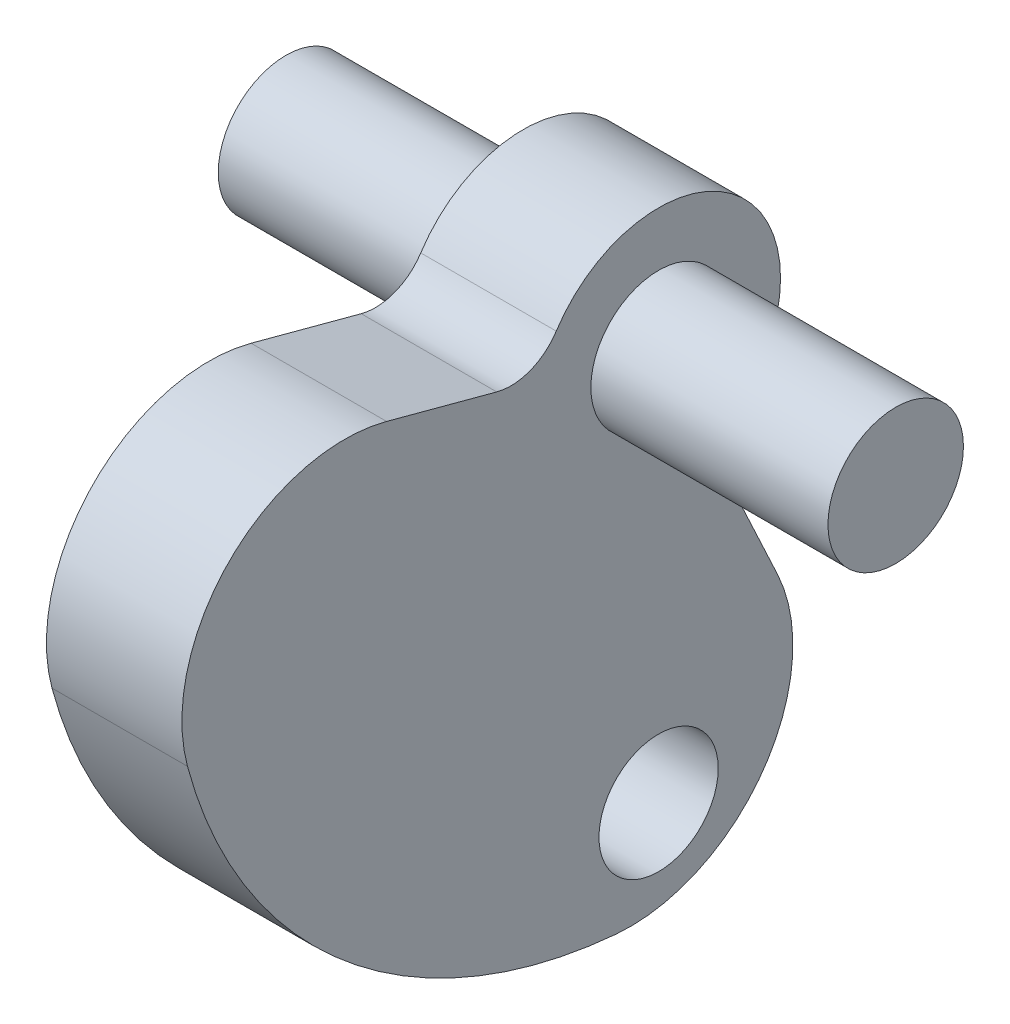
from build123d import *

# Parameters (mm, degrees)
SKETCH1_R      = 2.794
EXTRUDE1_DEPTH = 3.175
SKETCH2_R      = 3.175
EXTRUDE2_DEPTH = 14.2875
FILLET1_R      = 7.62


with BuildPart() as part:
    # Sketch1 → Extrude1 (new, symmetric)
    with BuildSketch(Plane(origin=(0, 0, 0), x_dir=(0, 0, -1), z_dir=(1, 0, 0))):
        with BuildLine():
            Line((3.31946199, -7.118609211), (9.661053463, -20.718196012))
            ThreePointArc((9.661053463, -20.718196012), (-14.694124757, -17.51177597), (-22.081064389, 5.916603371))
            Line((-22.081064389, 5.916603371), (-7.586880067, 2.032898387))
            ThreePointArc((-7.586880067, 2.032898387), (-6.017574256, 2.115690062), (-4.797332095, 3.105934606))
            ThreePointArc((-4.797332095, 3.105934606), (3.673531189, 4.377943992), (3.891796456, -4.185109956))
            ThreePointArc((3.891796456, -4.185109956), (3.128488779, -5.558768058), (3.31946199, -7.118609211))
        make_face()
        with Locations((0, -18.4404)):
            Circle(SKETCH1_R, mode=Mode.SUBTRACT)
    extrude(amount=EXTRUDE1_DEPTH, both=True)

    # Sketch2 → Extrude2 (add, symmetric)
    with BuildSketch(Plane(origin=(0, 0, 0), x_dir=(0, 0, -1), z_dir=(1, 0, 0))):
        with Locations(Location((0, 0, 0), (0, 0, 180))):
            Circle(SKETCH2_R)
    extrude(amount=EXTRUDE2_DEPTH, both=True)

    # Fillet1
    fillet1_edges = [part.edges().sort_by_distance(p)[0] for p in [
        (0, -20.718196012, -9.661053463),
        (0, 5.916603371, 22.081064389),
    ]]
    fillet(fillet1_edges, radius=FILLET1_R)


solid = part.part
